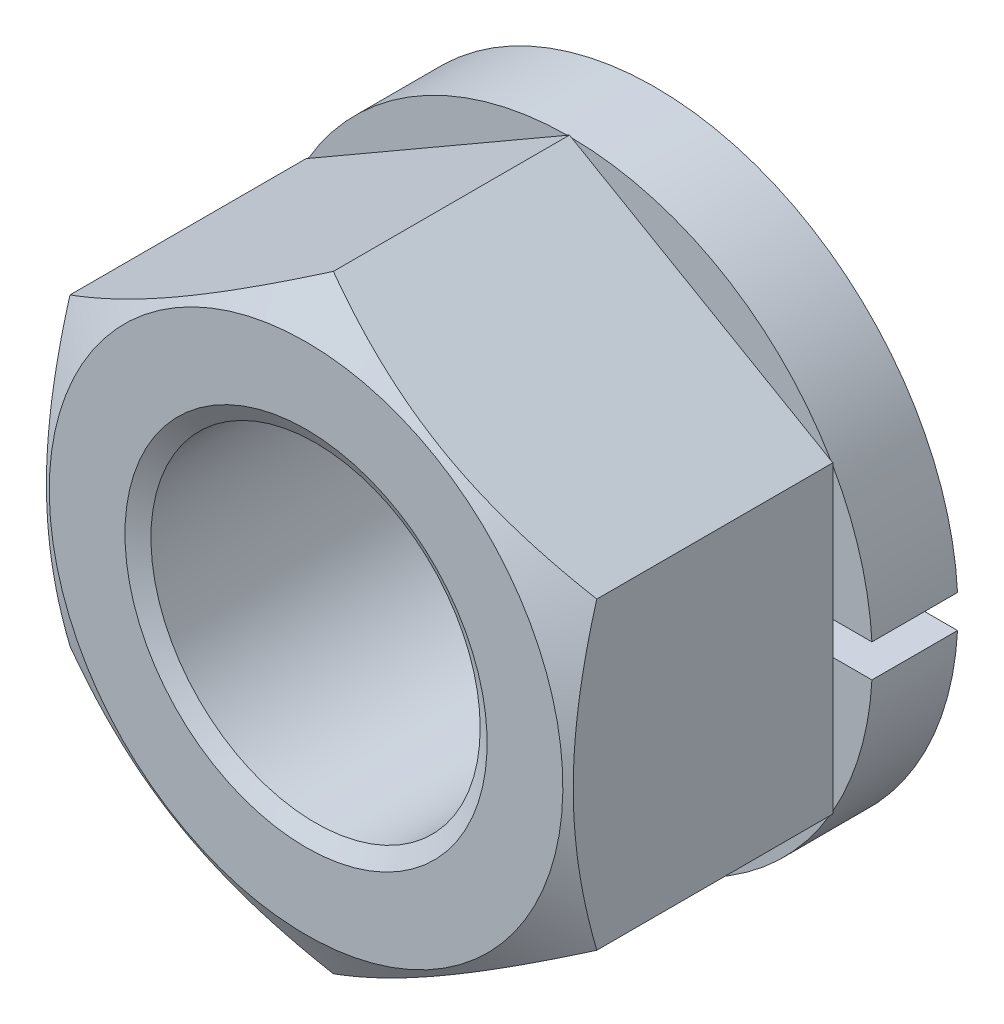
ISO-10303-21;
HEADER;
FILE_DESCRIPTION(('STEP AP214'),'2;1');
FILE_NAME('part.step','',(''),(''),'','','');
FILE_SCHEMA(('AUTOMOTIVE_DESIGN { 1 0 10303 214 1 1 1 1 }'));
ENDSEC;
DATA;
#1=APPLICATION_CONTEXT('core data for automotive mechanical design processes');
#2=APPLICATION_PROTOCOL_DEFINITION('international standard','automotive_design',2000,#1);
#3=PRODUCT_CONTEXT('',#1,'mechanical');
#4=PRODUCT('Part','Part','',(#3));
#5=PRODUCT_RELATED_PRODUCT_CATEGORY('part','',(#4));
#6=PRODUCT_DEFINITION_FORMATION('','',#4);
#7=PRODUCT_DEFINITION_CONTEXT('part definition',#1,'design');
#8=PRODUCT_DEFINITION('design','',#6,#7);
#9=PRODUCT_DEFINITION_SHAPE('','',#8);
#10=(LENGTH_UNIT() NAMED_UNIT(*) SI_UNIT(.MILLI.,.METRE.));
#11=(NAMED_UNIT(*) PLANE_ANGLE_UNIT() SI_UNIT($,.RADIAN.));
#12=(NAMED_UNIT(*) SI_UNIT($,.STERADIAN.) SOLID_ANGLE_UNIT());
#13=UNCERTAINTY_MEASURE_WITH_UNIT(LENGTH_MEASURE(1.E-05),#10,'distance_accuracy_value','');
#14=(GEOMETRIC_REPRESENTATION_CONTEXT(3) GLOBAL_UNCERTAINTY_ASSIGNED_CONTEXT((#13)) GLOBAL_UNIT_ASSIGNED_CONTEXT((#10,
#11,#12)) REPRESENTATION_CONTEXT('',''));
#15=CARTESIAN_POINT('',(0.,0.,0.));
#16=DIRECTION('',(0.,0.,1.));
#17=DIRECTION('',(1.,0.,0.));
#18=AXIS2_PLACEMENT_3D('',#15,#16,#17);
#19=CARTESIAN_POINT('',(4.,-6.92820323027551,1.3));
#20=DIRECTION('',(0.,0.,1.));
#21=DIRECTION('',(0.,1.,0.));
#22=AXIS2_PLACEMENT_3D('',#19,#20,#21);
#23=PLANE('',#22);
#24=CARTESIAN_POINT('',(0.,0.,1.3));
#25=DIRECTION('',(0.,0.,-1.));
#26=DIRECTION('',(0.,1.,0.));
#27=AXIS2_PLACEMENT_3D('',#24,#25,#26);
#28=CIRCLE('',#27,4.6);
#29=CARTESIAN_POINT('',(4.,-2.27156333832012,1.3));
#30=VERTEX_POINT('',#29);
#31=CARTESIAN_POINT('',(3.9672315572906,-2.3283199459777,1.3));
#32=VERTEX_POINT('',#31);
#33=EDGE_CURVE('E9',#30,#32,#28,.T.);
#34=ORIENTED_EDGE('',*,*,#33,.F.);
#35=DIRECTION('',(0.,1.,0.));
#36=VECTOR('',#35,1.);
#37=CARTESIAN_POINT('',(4.,-2.30940107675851,1.3));
#38=LINE('',#37,#36);
#39=CARTESIAN_POINT('',(4.,-2.30940107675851,1.3));
#40=VERTEX_POINT('',#39);
#41=EDGE_CURVE('E189',#40,#30,#38,.T.);
#42=ORIENTED_EDGE('',*,*,#41,.F.);
#43=DIRECTION('',(0.866025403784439,0.5,0.));
#44=VECTOR('',#43,1.);
#45=CARTESIAN_POINT('',(0.,-4.61880215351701,1.3));
#46=LINE('',#45,#44);
#47=EDGE_CURVE('E191',#32,#40,#46,.T.);
#48=ORIENTED_EDGE('',*,*,#47,.F.);
#49=EDGE_LOOP('',(#34,#42,#48));
#50=FACE_BOUND('',#49,.T.);
#51=ADVANCED_FACE('F14',(#50),#23,.F.);
#52=CARTESIAN_POINT('',(0.0327684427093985,-4.59988328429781,1.3));
#53=VERTEX_POINT('',#52);
#54=CARTESIAN_POINT('',(-0.0327684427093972,-4.59988328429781,1.3));
#55=VERTEX_POINT('',#54);
#56=EDGE_CURVE('E24',#53,#55,#28,.T.);
#57=ORIENTED_EDGE('',*,*,#56,.F.);
#58=CARTESIAN_POINT('',(0.,-4.61880215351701,1.3));
#59=VERTEX_POINT('',#58);
#60=EDGE_CURVE('E188',#59,#53,#46,.T.);
#61=ORIENTED_EDGE('',*,*,#60,.F.);
#62=DIRECTION('',(0.866025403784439,-0.5,0.));
#63=VECTOR('',#62,1.);
#64=CARTESIAN_POINT('',(-4.,-2.30940107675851,1.3));
#65=LINE('',#64,#63);
#66=EDGE_CURVE('E289',#55,#59,#65,.T.);
#67=ORIENTED_EDGE('',*,*,#66,.F.);
#68=EDGE_LOOP('',(#57,#61,#67));
#69=FACE_BOUND('',#68,.T.);
#70=ADVANCED_FACE('F387',(#69),#23,.F.);
#71=CARTESIAN_POINT('',(-3.9672315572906,-2.3283199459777,1.3));
#72=VERTEX_POINT('',#71);
#73=CARTESIAN_POINT('',(-4.,-2.27156333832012,1.3));
#74=VERTEX_POINT('',#73);
#75=EDGE_CURVE('E608',#72,#74,#28,.T.);
#76=ORIENTED_EDGE('',*,*,#75,.F.);
#77=CARTESIAN_POINT('',(-4.,-2.30940107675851,1.3));
#78=VERTEX_POINT('',#77);
#79=EDGE_CURVE('E285',#78,#72,#65,.T.);
#80=ORIENTED_EDGE('',*,*,#79,.F.);
#81=DIRECTION('',(0.,-1.,0.));
#82=VECTOR('',#81,1.);
#83=CARTESIAN_POINT('',(-4.,2.30940107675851,1.3));
#84=LINE('',#83,#82);
#85=EDGE_CURVE('E248',#74,#78,#84,.T.);
#86=ORIENTED_EDGE('',*,*,#85,.F.);
#87=EDGE_LOOP('',(#76,#80,#86));
#88=FACE_BOUND('',#87,.T.);
#89=ADVANCED_FACE('F623',(#88),#23,.F.);
#90=CARTESIAN_POINT('',(-4.,2.27156333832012,1.3));
#91=VERTEX_POINT('',#90);
#92=CARTESIAN_POINT('',(-3.9672315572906,2.3283199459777,1.3));
#93=VERTEX_POINT('',#92);
#94=EDGE_CURVE('E266',#91,#93,#28,.T.);
#95=ORIENTED_EDGE('',*,*,#94,.F.);
#96=CARTESIAN_POINT('',(-4.,2.30940107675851,1.3));
#97=VERTEX_POINT('',#96);
#98=EDGE_CURVE('E244',#97,#91,#84,.T.);
#99=ORIENTED_EDGE('',*,*,#98,.F.);
#100=DIRECTION('',(-0.866025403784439,-0.5,0.));
#101=VECTOR('',#100,1.);
#102=CARTESIAN_POINT('',(0.,4.61880215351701,1.3));
#103=LINE('',#102,#101);
#104=EDGE_CURVE('E252',#93,#97,#103,.T.);
#105=ORIENTED_EDGE('',*,*,#104,.F.);
#106=EDGE_LOOP('',(#95,#99,#105));
#107=FACE_BOUND('',#106,.T.);
#108=ADVANCED_FACE('F612',(#107),#23,.F.);
#109=CARTESIAN_POINT('',(-0.0327684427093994,4.59988328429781,1.3));
#110=VERTEX_POINT('',#109);
#111=CARTESIAN_POINT('',(0.0327684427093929,4.59988328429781,1.3));
#112=VERTEX_POINT('',#111);
#113=EDGE_CURVE('E179',#110,#112,#28,.T.);
#114=ORIENTED_EDGE('',*,*,#113,.F.);
#115=CARTESIAN_POINT('',(0.,4.61880215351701,1.3));
#116=VERTEX_POINT('',#115);
#117=EDGE_CURVE('E249',#116,#110,#103,.T.);
#118=ORIENTED_EDGE('',*,*,#117,.F.);
#119=DIRECTION('',(-0.866025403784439,0.5,0.));
#120=VECTOR('',#119,1.);
#121=CARTESIAN_POINT('',(4.,2.3094010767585,1.3));
#122=LINE('',#121,#120);
#123=EDGE_CURVE('E194',#112,#116,#122,.T.);
#124=ORIENTED_EDGE('',*,*,#123,.F.);
#125=EDGE_LOOP('',(#114,#118,#124));
#126=FACE_BOUND('',#125,.T.);
#127=ADVANCED_FACE('F268',(#126),#23,.F.);
#128=CARTESIAN_POINT('',(3.96723155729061,2.32831994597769,1.3));
#129=VERTEX_POINT('',#128);
#130=CARTESIAN_POINT('',(4.,2.27156333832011,1.3));
#131=VERTEX_POINT('',#130);
#132=EDGE_CURVE('E168',#129,#131,#28,.T.);
#133=ORIENTED_EDGE('',*,*,#132,.F.);
#134=CARTESIAN_POINT('',(4.,2.3094010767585,1.3));
#135=VERTEX_POINT('',#134);
#136=EDGE_CURVE('E187',#135,#129,#122,.T.);
#137=ORIENTED_EDGE('',*,*,#136,.F.);
#138=EDGE_CURVE('E156',#131,#135,#38,.T.);
#139=ORIENTED_EDGE('',*,*,#138,.F.);
#140=EDGE_LOOP('',(#133,#137,#139));
#141=FACE_BOUND('',#140,.T.);
#142=ADVANCED_FACE('F186',(#141),#23,.F.);
#143=DIRECTION('',(1.,0.,0.));
#144=VECTOR('',#143,1.);
#145=CARTESIAN_POINT('',(2.53771550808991,-0.25,1.3));
#146=LINE('',#145,#144);
#147=CARTESIAN_POINT('',(2.73861278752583,-0.25,1.3));
#148=VERTEX_POINT('',#147);
#149=CARTESIAN_POINT('',(4.,-0.25,1.3));
#150=VERTEX_POINT('',#149);
#151=EDGE_CURVE('E180',#148,#150,#146,.T.);
#152=ORIENTED_EDGE('',*,*,#151,.F.);
#153=CARTESIAN_POINT('',(0.,0.,1.3));
#154=DIRECTION('',(0.,0.,1.));
#155=DIRECTION('',(0.,1.,0.));
#156=AXIS2_PLACEMENT_3D('',#153,#154,#155);
#157=CIRCLE('',#156,2.75);
#158=CARTESIAN_POINT('',(2.73861278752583,0.25,1.3));
#159=VERTEX_POINT('',#158);
#160=EDGE_CURVE('E217',#148,#159,#157,.T.);
#161=ORIENTED_EDGE('',*,*,#160,.T.);
#162=DIRECTION('',(-1.,0.,0.));
#163=VECTOR('',#162,1.);
#164=CARTESIAN_POINT('',(2.53771550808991,0.25,1.3));
#165=LINE('',#164,#163);
#166=CARTESIAN_POINT('',(4.,0.25,1.3));
#167=VERTEX_POINT('',#166);
#168=EDGE_CURVE('E215',#167,#159,#165,.T.);
#169=ORIENTED_EDGE('',*,*,#168,.F.);
#170=EDGE_CURVE('E160',#150,#167,#38,.T.);
#171=ORIENTED_EDGE('',*,*,#170,.F.);
#172=EDGE_LOOP('',(#152,#161,#169,#171));
#173=FACE_BOUND('',#172,.T.);
#174=ADVANCED_FACE('F211',(#173),#23,.F.);
#175=CARTESIAN_POINT('',(-4.,-2.30940107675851,5.3));
#176=DIRECTION('',(0.5,0.866025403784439,0.));
#177=DIRECTION('',(-0.866025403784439,0.5,0.));
#178=AXIS2_PLACEMENT_3D('',#175,#176,#177);
#179=PLANE('',#178);
#180=CARTESIAN_POINT('',(-4.0002,-2.30928560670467,4.88493271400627));
#181=CARTESIAN_POINT('',(-3.82442084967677,-2.41077174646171,4.94354709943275));
#182=CARTESIAN_POINT('',(-3.64712438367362,-2.513133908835,4.99685465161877));
#183=CARTESIAN_POINT('',(-3.28946140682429,-2.71963072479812,5.08990330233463));
#184=CARTESIAN_POINT('',(-3.10908854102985,-2.82376904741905,5.12961148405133));
#185=CARTESIAN_POINT('',(-2.75057818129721,-3.03075510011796,5.19142275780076));
#186=CARTESIAN_POINT('',(-2.57249584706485,-3.13357098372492,5.21393724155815));
#187=CARTESIAN_POINT('',(-2.21549328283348,-3.33968651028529,5.24081434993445));
#188=CARTESIAN_POINT('',(-2.03657435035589,-3.44298540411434,5.24519923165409));
#189=CARTESIAN_POINT('',(-1.70225715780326,-3.63600352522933,5.23607490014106));
#190=CARTESIAN_POINT('',(-1.54680884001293,-3.72575165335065,5.22480601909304));
#191=CARTESIAN_POINT('',(-1.23692494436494,-3.90466320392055,5.18909098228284));
#192=CARTESIAN_POINT('',(-1.08249043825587,-3.99382600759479,5.1646326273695));
#193=CARTESIAN_POINT('',(-0.77196767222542,-4.17310641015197,5.10348890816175));
#194=CARTESIAN_POINT('',(-0.615918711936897,-4.26320131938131,5.06654436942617));
#195=CARTESIAN_POINT('',(-0.306148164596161,-4.4420474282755,4.98269490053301));
#196=CARTESIAN_POINT('',(-0.152422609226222,-4.53080091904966,4.9358096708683));
#197=CARTESIAN_POINT('',(0.000199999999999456,-4.61891762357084,4.88493271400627));
#198=B_SPLINE_CURVE_WITH_KNOTS('',3,(#180,#181,#182,#183,#184,#185,#186,#187,#188,#189,#190,
#191,#192,#193,#194,#195,#196,#197),.UNSPECIFIED.,.F.,.F.,(4,2,2,2,2,2,2,2,4),(0.,
0.634047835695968,1.26961969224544,1.88946157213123,2.50854226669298,3.04757825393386,
3.58711366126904,4.13861653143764,4.68903648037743),.UNSPECIFIED.);
#199=CARTESIAN_POINT('',(-4.,-2.30940107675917,4.88499938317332));
#200=VERTEX_POINT('',#199);
#201=CARTESIAN_POINT('',(0.,-4.61880215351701,4.88499938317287));
#202=VERTEX_POINT('',#201);
#203=EDGE_CURVE('E296',#200,#202,#198,.T.);
#204=ORIENTED_EDGE('',*,*,#203,.F.);
#205=DIRECTION('',(0.,0.,-1.));
#206=VECTOR('',#205,1.);
#207=CARTESIAN_POINT('',(-4.,-2.30940107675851,5.3));
#208=LINE('',#207,#206);
#209=EDGE_CURVE('E241',#200,#78,#208,.T.);
#210=ORIENTED_EDGE('',*,*,#209,.T.);
#211=ORIENTED_EDGE('',*,*,#79,.T.);
#212=EDGE_CURVE('E287',#72,#55,#65,.T.);
#213=ORIENTED_EDGE('',*,*,#212,.T.);
#214=ORIENTED_EDGE('',*,*,#66,.T.);
#215=DIRECTION('',(0.,0.,-1.));
#216=VECTOR('',#215,1.);
#217=CARTESIAN_POINT('',(0.,-4.61880215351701,5.3));
#218=LINE('',#217,#216);
#219=EDGE_CURVE('E220',#202,#59,#218,.T.);
#220=ORIENTED_EDGE('',*,*,#219,.F.);
#221=EDGE_LOOP('',(#204,#210,#211,#213,#214,#220));
#222=FACE_BOUND('',#221,.T.);
#223=ADVANCED_FACE('F309',(#222),#179,.F.);
#224=CARTESIAN_POINT('',(0.,-4.61880215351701,5.3));
#225=DIRECTION('',(-0.5,0.866025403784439,0.));
#226=DIRECTION('',(-0.866025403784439,-0.5,0.));
#227=AXIS2_PLACEMENT_3D('',#224,#225,#226);
#228=PLANE('',#227);
#229=CARTESIAN_POINT('',(-0.000200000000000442,-4.61891762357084,4.88493271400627));
#230=CARTESIAN_POINT('',(0.17557915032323,-4.5174314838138,4.94354709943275));
#231=CARTESIAN_POINT('',(0.352875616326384,-4.41506932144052,4.99685465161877));
#232=CARTESIAN_POINT('',(0.71053859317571,-4.2085725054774,5.08990330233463));
#233=CARTESIAN_POINT('',(0.890911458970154,-4.10443418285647,5.12961148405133));
#234=CARTESIAN_POINT('',(1.24942181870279,-3.89744813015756,5.19142275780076));
#235=CARTESIAN_POINT('',(1.42750415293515,-3.7946322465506,5.21393724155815));
#236=CARTESIAN_POINT('',(1.78450671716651,-3.58851671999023,5.24081434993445));
#237=CARTESIAN_POINT('',(1.9634256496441,-3.48521782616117,5.24519923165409));
#238=CARTESIAN_POINT('',(2.29774284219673,-3.29219970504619,5.23607490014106));
#239=CARTESIAN_POINT('',(2.45319115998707,-3.20245157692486,5.22480601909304));
#240=CARTESIAN_POINT('',(2.76307505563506,-3.02354002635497,5.18909098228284));
#241=CARTESIAN_POINT('',(2.91750956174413,-2.93437722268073,5.1646326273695));
#242=CARTESIAN_POINT('',(3.22803232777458,-2.75509682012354,5.10348890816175));
#243=CARTESIAN_POINT('',(3.3840812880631,-2.6650019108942,5.06654436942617));
#244=CARTESIAN_POINT('',(3.69385183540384,-2.48615580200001,4.98269490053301));
#245=CARTESIAN_POINT('',(3.84757739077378,-2.39740231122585,4.9358096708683));
#246=CARTESIAN_POINT('',(4.0002,-2.30928560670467,4.88493271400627));
#247=B_SPLINE_CURVE_WITH_KNOTS('',3,(#229,#230,#231,#232,#233,#234,#235,#236,#237,#238,#239,
#240,#241,#242,#243,#244,#245,#246),.UNSPECIFIED.,.F.,.F.,(4,2,2,2,2,2,2,2,4),(0.,
0.634047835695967,1.26961969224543,1.88946157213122,2.50854226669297,3.04757825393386,
3.58711366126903,4.13861653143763,4.68903648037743),.UNSPECIFIED.);
#248=CARTESIAN_POINT('',(4.,-2.30940107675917,4.88499938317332));
#249=VERTEX_POINT('',#248);
#250=EDGE_CURVE('E278',#202,#249,#247,.T.);
#251=ORIENTED_EDGE('',*,*,#250,.F.);
#252=ORIENTED_EDGE('',*,*,#219,.T.);
#253=ORIENTED_EDGE('',*,*,#60,.T.);
#254=EDGE_CURVE('E34',#53,#32,#46,.T.);
#255=ORIENTED_EDGE('',*,*,#254,.T.);
#256=ORIENTED_EDGE('',*,*,#47,.T.);
#257=DIRECTION('',(0.,0.,-1.));
#258=VECTOR('',#257,1.);
#259=CARTESIAN_POINT('',(4.,-2.30940107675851,5.3));
#260=LINE('',#259,#258);
#261=EDGE_CURVE('E224',#249,#40,#260,.T.);
#262=ORIENTED_EDGE('',*,*,#261,.F.);
#263=EDGE_LOOP('',(#251,#252,#253,#255,#256,#262));
#264=FACE_BOUND('',#263,.T.);
#265=ADVANCED_FACE('F281',(#264),#228,.F.);
#266=CARTESIAN_POINT('',(4.,-2.30940107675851,5.3));
#267=DIRECTION('',(-1.,0.,0.));
#268=DIRECTION('',(0.,-1.,0.));
#269=AXIS2_PLACEMENT_3D('',#266,#267,#268);
#270=PLANE('',#269);
#271=CARTESIAN_POINT('',(4.,-6.19830752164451,3.29259666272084));
#272=CARTESIAN_POINT('',(4.,-6.02358741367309,3.37733132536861));
#273=CARTESIAN_POINT('',(4.,-5.84846556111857,3.46125183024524));
#274=CARTESIAN_POINT('',(4.,-5.497204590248,3.62700632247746));
#275=CARTESIAN_POINT('',(4.,-5.3210653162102,3.7088399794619));
#276=CARTESIAN_POINT('',(4.,-4.96664644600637,3.87037504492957));
#277=CARTESIAN_POINT('',(4.,-4.7883604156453,3.95006238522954));
#278=CARTESIAN_POINT('',(4.,-4.43036789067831,4.10616743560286));
#279=CARTESIAN_POINT('',(4.,-4.25066146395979,4.1825853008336));
#280=CARTESIAN_POINT('',(4.,-3.883877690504,4.33362019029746));
#281=CARTESIAN_POINT('',(4.,-3.69674587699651,4.40810566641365));
#282=CARTESIAN_POINT('',(4.,-3.32029141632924,4.55142705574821));
#283=CARTESIAN_POINT('',(4.,-3.13096852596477,4.62026233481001));
#284=CARTESIAN_POINT('',(4.,-2.75018617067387,4.75047348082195));
#285=CARTESIAN_POINT('',(4.,-2.55873192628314,4.81186446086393));
#286=CARTESIAN_POINT('',(4.,-2.17307788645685,4.92521431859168));
#287=CARTESIAN_POINT('',(4.,-1.97887897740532,4.97717616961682));
#288=CARTESIAN_POINT('',(4.,-1.58864256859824,5.06891001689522));
#289=CARTESIAN_POINT('',(4.,-1.3926199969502,5.10874434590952));
#290=CARTESIAN_POINT('',(4.,-0.998143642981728,5.17394634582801));
#291=CARTESIAN_POINT('',(4.,-0.799690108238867,5.19931547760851));
#292=CARTESIAN_POINT('',(4.,-0.403932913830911,5.23323151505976));
#293=CARTESIAN_POINT('',(4.,-0.206648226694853,5.24199435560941));
#294=CARTESIAN_POINT('',(4.,0.187963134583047,5.24252299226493));
#295=CARTESIAN_POINT('',(4.,0.385289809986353,5.23428817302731));
#296=CARTESIAN_POINT('',(4.,0.720346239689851,5.206455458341));
#297=CARTESIAN_POINT('',(4.,0.858435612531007,5.19094029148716));
#298=CARTESIAN_POINT('',(4.,1.13359497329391,5.15255337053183));
#299=CARTESIAN_POINT('',(4.,1.27066482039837,5.12968061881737));
#300=CARTESIAN_POINT('',(4.,1.68015906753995,5.05122936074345));
#301=CARTESIAN_POINT('',(4.,1.95072275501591,4.98583152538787));
#302=CARTESIAN_POINT('',(4.,2.35547112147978,4.87249475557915));
#303=CARTESIAN_POINT('',(4.,2.4917524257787,4.83161840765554));
#304=CARTESIAN_POINT('',(4.,2.76298992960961,4.74564464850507));
#305=CARTESIAN_POINT('',(4.,2.89794611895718,4.7005472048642));
#306=CARTESIAN_POINT('',(4.,3.16657958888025,4.60685321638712));
#307=CARTESIAN_POINT('',(4.,3.30025725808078,4.55825777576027));
#308=CARTESIAN_POINT('',(4.,3.56650379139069,4.45813729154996));
#309=CARTESIAN_POINT('',(4.,3.6990726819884,4.40661231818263));
#310=CARTESIAN_POINT('',(4.,4.06393124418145,4.26091200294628));
#311=CARTESIAN_POINT('',(4.,4.2951943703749,4.16416822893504));
#312=CARTESIAN_POINT('',(4.,4.75532375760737,3.9651196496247));
#313=CARTESIAN_POINT('',(4.,4.98418974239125,3.86281421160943));
#314=CARTESIAN_POINT('',(4.,5.44008918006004,3.65400373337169));
#315=CARTESIAN_POINT('',(4.,5.66712195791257,3.54749722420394));
#316=CARTESIAN_POINT('',(4.,6.11967322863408,3.33130772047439));
#317=CARTESIAN_POINT('',(4.,6.3451916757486,3.22162463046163));
#318=CARTESIAN_POINT('',(4.,6.79536429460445,2.9996241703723));
#319=CARTESIAN_POINT('',(4.,7.02001656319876,2.88730294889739));
#320=CARTESIAN_POINT('',(4.,7.46833630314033,2.66071005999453));
#321=CARTESIAN_POINT('',(4.,7.69200376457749,2.54643837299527));
#322=CARTESIAN_POINT('',(4.,8.36171005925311,2.20135857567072));
#323=CARTESIAN_POINT('',(4.,8.80655510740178,1.96823479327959));
#324=CARTESIAN_POINT('',(4.,9.64574719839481,1.52350784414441));
#325=CARTESIAN_POINT('',(4.,10.0403183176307,1.31232552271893));
#326=CARTESIAN_POINT('',(4.,10.8282076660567,0.887578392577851));
#327=CARTESIAN_POINT('',(4.,11.2215258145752,0.674013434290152));
#328=CARTESIAN_POINT('',(4.,12.005915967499,0.245830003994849));
#329=CARTESIAN_POINT('',(4.,12.3969911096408,0.0312172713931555));
#330=CARTESIAN_POINT('',(4.,13.1783621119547,-0.399350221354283));
#331=CARTESIAN_POINT('',(4.,13.5686580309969,-0.615304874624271));
#332=CARTESIAN_POINT('',(4.,13.9586822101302,-0.831746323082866));
#333=B_SPLINE_CURVE_WITH_KNOTS('',3,(#271,#272,#273,#274,#275,#276,#277,#278,#279,#280,#281,
#282,#283,#284,#285,#286,#287,#288,#289,#290,#291,#292,#293,#294,#295,#296,#297,#298,#299,#300,
#301,#302,#303,#304,#305,#306,#307,#308,#309,#310,#311,#312,#313,#314,#315,#316,#317,#318,#319,
#320,#321,#322,#323,#324,#325,#326,#327,#328,#329,#330,#331,#332),.UNSPECIFIED.,.F.,.F.,(4,2,2,
2,2,2,2,2,2,2,2,2,2,2,2,2,2,2,2,2,2,2,2,2,2,2,2,2,2,2,4),(0.,0.582556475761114,1.16520461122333,
1.75103140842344,2.33683037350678,2.94099294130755,3.54522322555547,4.14820552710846,
4.75099735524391,5.35063652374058,5.95021512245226,6.54194230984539,7.13369091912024,
7.55036371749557,7.9670930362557,8.80098786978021,9.22779049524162,9.65459639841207,
10.081268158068,10.5079296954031,11.259867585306,12.0118911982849,12.7641801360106,
13.5164917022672,14.2699797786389,15.0234754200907,16.5301238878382,17.8727098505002,
19.2153805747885,20.553654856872,21.891823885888),.UNSPECIFIED.);
#334=CARTESIAN_POINT('',(4.,2.3094010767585,4.88499938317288));
#335=VERTEX_POINT('',#334);
#336=EDGE_CURVE('E275',#249,#335,#333,.T.);
#337=ORIENTED_EDGE('',*,*,#336,.F.);
#338=ORIENTED_EDGE('',*,*,#261,.T.);
#339=ORIENTED_EDGE('',*,*,#41,.T.);
#340=EDGE_CURVE('E195',#30,#150,#38,.T.);
#341=ORIENTED_EDGE('',*,*,#340,.T.);
#342=ORIENTED_EDGE('',*,*,#170,.T.);
#343=EDGE_CURVE('E150',#167,#131,#38,.T.);
#344=ORIENTED_EDGE('',*,*,#343,.T.);
#345=ORIENTED_EDGE('',*,*,#138,.T.);
#346=DIRECTION('',(0.,0.,-1.));
#347=VECTOR('',#346,1.);
#348=CARTESIAN_POINT('',(4.,2.3094010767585,5.3));
#349=LINE('',#348,#347);
#350=EDGE_CURVE('E233',#335,#135,#349,.T.);
#351=ORIENTED_EDGE('',*,*,#350,.F.);
#352=EDGE_LOOP('',(#337,#338,#339,#341,#342,#344,#345,#351));
#353=FACE_BOUND('',#352,.T.);
#354=ADVANCED_FACE('F153',(#353),#270,.F.);
#355=CARTESIAN_POINT('',(4.,2.3094010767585,5.3));
#356=DIRECTION('',(-0.5,-0.866025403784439,0.));
#357=DIRECTION('',(0.866025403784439,-0.5,0.));
#358=AXIS2_PLACEMENT_3D('',#355,#356,#357);
#359=PLANE('',#358);
#360=CARTESIAN_POINT('',(4.0002,2.30928560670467,4.88493271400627));
#361=CARTESIAN_POINT('',(3.82442084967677,2.4107717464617,4.94354709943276));
#362=CARTESIAN_POINT('',(3.64712438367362,2.51313390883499,4.99685465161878));
#363=CARTESIAN_POINT('',(3.28946140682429,2.71963072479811,5.08990330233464));
#364=CARTESIAN_POINT('',(3.10908854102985,2.82376904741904,5.12961148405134));
#365=CARTESIAN_POINT('',(2.75057818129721,3.03075510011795,5.19142275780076));
#366=CARTESIAN_POINT('',(2.57249584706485,3.13357098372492,5.21393724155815));
#367=CARTESIAN_POINT('',(2.21549328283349,3.33968651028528,5.24081434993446));
#368=CARTESIAN_POINT('',(2.03657435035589,3.44298540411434,5.2451992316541));
#369=CARTESIAN_POINT('',(1.70225715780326,3.63600352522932,5.23607490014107));
#370=CARTESIAN_POINT('',(1.54680884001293,3.72575165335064,5.22480601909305));
#371=CARTESIAN_POINT('',(1.23692494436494,3.90466320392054,5.18909098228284));
#372=CARTESIAN_POINT('',(1.08249043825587,3.99382600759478,5.16463262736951));
#373=CARTESIAN_POINT('',(0.771967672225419,4.17310641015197,5.10348890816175));
#374=CARTESIAN_POINT('',(0.615918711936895,4.26320131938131,5.06654436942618));
#375=CARTESIAN_POINT('',(0.306148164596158,4.4420474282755,4.98269490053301));
#376=CARTESIAN_POINT('',(0.152422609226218,4.53080091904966,4.9358096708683));
#377=CARTESIAN_POINT('',(-0.000200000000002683,4.61891762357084,4.88493271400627));
#378=B_SPLINE_CURVE_WITH_KNOTS('',3,(#360,#361,#362,#363,#364,#365,#366,#367,#368,#369,#370,
#371,#372,#373,#374,#375,#376,#377),.UNSPECIFIED.,.F.,.F.,(4,2,2,2,2,2,2,2,4),(0.,
0.634047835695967,1.26961969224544,1.88946157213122,2.50854226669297,3.04757825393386,
3.58711366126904,4.13861653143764,4.68903648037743),.UNSPECIFIED.);
#379=CARTESIAN_POINT('',(0.,4.61880215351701,4.88499938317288));
#380=VERTEX_POINT('',#379);
#381=EDGE_CURVE('E274',#335,#380,#378,.T.);
#382=ORIENTED_EDGE('',*,*,#381,.F.);
#383=ORIENTED_EDGE('',*,*,#350,.T.);
#384=ORIENTED_EDGE('',*,*,#136,.T.);
#385=EDGE_CURVE('E198',#129,#112,#122,.T.);
#386=ORIENTED_EDGE('',*,*,#385,.T.);
#387=ORIENTED_EDGE('',*,*,#123,.T.);
#388=DIRECTION('',(0.,0.,-1.));
#389=VECTOR('',#388,1.);
#390=CARTESIAN_POINT('',(0.,4.61880215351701,5.3));
#391=LINE('',#390,#389);
#392=EDGE_CURVE('E235',#380,#116,#391,.T.);
#393=ORIENTED_EDGE('',*,*,#392,.F.);
#394=EDGE_LOOP('',(#382,#383,#384,#386,#387,#393));
#395=FACE_BOUND('',#394,.T.);
#396=ADVANCED_FACE('F255',(#395),#359,.F.);
#397=CARTESIAN_POINT('',(0.,4.61880215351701,5.3));
#398=DIRECTION('',(0.5,-0.866025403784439,0.));
#399=DIRECTION('',(0.866025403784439,0.5,0.));
#400=AXIS2_PLACEMENT_3D('',#397,#398,#399);
#401=PLANE('',#400);
#402=CARTESIAN_POINT('',(0.000199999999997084,4.61891762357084,4.88493271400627));
#403=CARTESIAN_POINT('',(-0.175579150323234,4.5174314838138,4.94354709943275));
#404=CARTESIAN_POINT('',(-0.352875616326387,4.41506932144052,4.99685465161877));
#405=CARTESIAN_POINT('',(-0.710538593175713,4.2085725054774,5.08990330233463));
#406=CARTESIAN_POINT('',(-0.890911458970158,4.10443418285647,5.12961148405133));
#407=CARTESIAN_POINT('',(-1.2494218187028,3.89744813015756,5.19142275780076));
#408=CARTESIAN_POINT('',(-1.42750415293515,3.7946322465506,5.21393724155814));
#409=CARTESIAN_POINT('',(-1.78450671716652,3.58851671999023,5.24081434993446));
#410=CARTESIAN_POINT('',(-1.9634256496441,3.48521782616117,5.2451992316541));
#411=CARTESIAN_POINT('',(-2.29774284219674,3.29219970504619,5.23607490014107));
#412=CARTESIAN_POINT('',(-2.45319115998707,3.20245157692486,5.22480601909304));
#413=CARTESIAN_POINT('',(-2.76307505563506,3.02354002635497,5.18909098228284));
#414=CARTESIAN_POINT('',(-2.91750956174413,2.93437722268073,5.1646326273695));
#415=CARTESIAN_POINT('',(-3.22803232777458,2.75509682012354,5.10348890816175));
#416=CARTESIAN_POINT('',(-3.38408128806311,2.6650019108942,5.06654436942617));
#417=CARTESIAN_POINT('',(-3.69385183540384,2.48615580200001,4.98269490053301));
#418=CARTESIAN_POINT('',(-3.84757739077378,2.39740231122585,4.93580967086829));
#419=CARTESIAN_POINT('',(-4.0002,2.30928560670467,4.88493271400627));
#420=B_SPLINE_CURVE_WITH_KNOTS('',3,(#402,#403,#404,#405,#406,#407,#408,#409,#410,#411,#412,
#413,#414,#415,#416,#417,#418,#419),.UNSPECIFIED.,.F.,.F.,(4,2,2,2,2,2,2,2,4),(0.,
0.634047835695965,1.26961969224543,1.88946157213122,2.50854226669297,3.04757825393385,
3.58711366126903,4.13861653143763,4.68903648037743),.UNSPECIFIED.);
#421=CARTESIAN_POINT('',(-4.,2.30940107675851,4.88499938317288));
#422=VERTEX_POINT('',#421);
#423=EDGE_CURVE('E273',#380,#422,#420,.T.);
#424=ORIENTED_EDGE('',*,*,#423,.F.);
#425=ORIENTED_EDGE('',*,*,#392,.T.);
#426=ORIENTED_EDGE('',*,*,#117,.T.);
#427=EDGE_CURVE('E251',#110,#93,#103,.T.);
#428=ORIENTED_EDGE('',*,*,#427,.T.);
#429=ORIENTED_EDGE('',*,*,#104,.T.);
#430=DIRECTION('',(0.,0.,-1.));
#431=VECTOR('',#430,1.);
#432=CARTESIAN_POINT('',(-4.,2.30940107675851,5.3));
#433=LINE('',#432,#431);
#434=EDGE_CURVE('E238',#422,#97,#433,.T.);
#435=ORIENTED_EDGE('',*,*,#434,.F.);
#436=EDGE_LOOP('',(#424,#425,#426,#428,#429,#435));
#437=FACE_BOUND('',#436,.T.);
#438=ADVANCED_FACE('F271',(#437),#401,.F.);
#439=CARTESIAN_POINT('',(-4.,2.30940107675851,5.3));
#440=DIRECTION('',(1.,0.,0.));
#441=DIRECTION('',(0.,1.,0.));
#442=AXIS2_PLACEMENT_3D('',#439,#440,#441);
#443=PLANE('',#442);
#444=CARTESIAN_POINT('',(-4.,-6.19830752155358,3.29259666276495));
#445=CARTESIAN_POINT('',(-4.,-6.02358741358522,3.37733132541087));
#446=CARTESIAN_POINT('',(-4.,-5.84846556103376,3.46125183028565));
#447=CARTESIAN_POINT('',(-4.,-5.49720459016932,3.62700632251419));
#448=CARTESIAN_POINT('',(-4.,-5.32106531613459,3.70883997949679));
#449=CARTESIAN_POINT('',(-4.,-4.96664644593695,3.87037504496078));
#450=CARTESIAN_POINT('',(-4.,-4.78836041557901,3.95006238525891));
#451=CARTESIAN_POINT('',(-4.,-4.43036789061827,4.10616743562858));
#452=CARTESIAN_POINT('',(-4.,-4.2506614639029,4.18258530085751));
#453=CARTESIAN_POINT('',(-4.,-3.88387769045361,4.33362019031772));
#454=CARTESIAN_POINT('',(-4.,-3.69674587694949,4.40810566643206));
#455=CARTESIAN_POINT('',(-4.,-3.320291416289,4.55142705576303));
#456=CARTESIAN_POINT('',(-4.,-3.13096852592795,4.62026233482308));
#457=CARTESIAN_POINT('',(-4.,-2.75018617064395,4.7504734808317));
#458=CARTESIAN_POINT('',(-4.,-2.5587319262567,4.8118644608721));
#459=CARTESIAN_POINT('',(-4.,-2.17307788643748,4.92521431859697));
#460=CARTESIAN_POINT('',(-4.,-1.97887897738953,4.97717616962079));
#461=CARTESIAN_POINT('',(-4.,-1.58864256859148,5.06891001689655));
#462=CARTESIAN_POINT('',(-4.,-1.39261999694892,5.10874434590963));
#463=CARTESIAN_POINT('',(-4.,-0.998143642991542,5.1739463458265));
#464=CARTESIAN_POINT('',(-4.,-0.799690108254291,5.1993154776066));
#465=CARTESIAN_POINT('',(-4.,-0.40393291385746,5.23323151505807));
#466=CARTESIAN_POINT('',(-4.,-0.206648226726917,5.2419943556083));
#467=CARTESIAN_POINT('',(-4.,0.187963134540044,5.24252299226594));
#468=CARTESIAN_POINT('',(-4.,0.385289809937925,5.23428817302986));
#469=CARTESIAN_POINT('',(-4.,0.72034623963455,5.20645545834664));
#470=CARTESIAN_POINT('',(-4.,0.858435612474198,5.19094029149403));
#471=CARTESIAN_POINT('',(-4.,1.13359497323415,5.15255337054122));
#472=CARTESIAN_POINT('',(-4.,1.27066482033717,5.12968061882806));
#473=CARTESIAN_POINT('',(-4.,1.68015906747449,5.05122936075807));
#474=CARTESIAN_POINT('',(-4.,1.95072275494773,4.98583152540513));
#475=CARTESIAN_POINT('',(-4.,2.35547112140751,4.87249475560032));
#476=CARTESIAN_POINT('',(-4.,2.49175242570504,4.83161840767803));
#477=CARTESIAN_POINT('',(-4.,2.76298992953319,4.74564464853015));
#478=CARTESIAN_POINT('',(-4.,2.89794611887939,4.70054720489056));
#479=CARTESIAN_POINT('',(-4.,3.16657958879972,4.60685321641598));
#480=CARTESIAN_POINT('',(-4.,3.30025725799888,4.55825777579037));
#481=CARTESIAN_POINT('',(-4.,3.56650379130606,4.45813729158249));
#482=CARTESIAN_POINT('',(-4.,3.6990726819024,4.40661231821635));
#483=CARTESIAN_POINT('',(-4.,4.06393124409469,4.26091200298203));
#484=CARTESIAN_POINT('',(-4.,4.29519437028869,4.16416822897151));
#485=CARTESIAN_POINT('',(-4.,4.75532375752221,3.96511964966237));
#486=CARTESIAN_POINT('',(-4.,4.98418974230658,3.86281421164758));
#487=CARTESIAN_POINT('',(-4.,5.44008917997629,3.65400373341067));
#488=CARTESIAN_POINT('',(-4.,5.66712195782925,3.54749722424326));
#489=CARTESIAN_POINT('',(-4.,6.11967322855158,3.33130772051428));
#490=CARTESIAN_POINT('',(-4.,6.34519167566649,3.22162463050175));
#491=CARTESIAN_POINT('',(-4.,6.7953642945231,2.99962417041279));
#492=CARTESIAN_POINT('',(-4.,7.02001656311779,2.88730294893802));
#493=CARTESIAN_POINT('',(-4.,7.46833630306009,2.66071006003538));
#494=CARTESIAN_POINT('',(-4.,7.69200376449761,2.5464383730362));
#495=CARTESIAN_POINT('',(-4.,8.36171005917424,2.20135857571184));
#496=CARTESIAN_POINT('',(-4.,8.80655510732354,1.96823479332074));
#497=CARTESIAN_POINT('',(-4.,9.64574719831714,1.52350784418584));
#498=CARTESIAN_POINT('',(-4.,10.040318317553,1.31232552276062));
#499=CARTESIAN_POINT('',(-4.,10.8282076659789,0.887578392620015));
#500=CARTESIAN_POINT('',(-4.,11.2215258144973,0.67401343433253));
#501=CARTESIAN_POINT('',(-4.,12.0059159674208,0.245830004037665));
#502=CARTESIAN_POINT('',(-4.00000000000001,12.3969911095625,0.0312172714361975));
#503=CARTESIAN_POINT('',(-4.,13.178362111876,-0.399350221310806));
#504=CARTESIAN_POINT('',(-4.,13.5686580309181,-0.615304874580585));
#505=CARTESIAN_POINT('',(-4.,13.9586822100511,-0.831746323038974));
#506=B_SPLINE_CURVE_WITH_KNOTS('',3,(#444,#445,#446,#447,#448,#449,#450,#451,#452,#453,#454,
#455,#456,#457,#458,#459,#460,#461,#462,#463,#464,#465,#466,#467,#468,#469,#470,#471,#472,#473,
#474,#475,#476,#477,#478,#479,#480,#481,#482,#483,#484,#485,#486,#487,#488,#489,#490,#491,#492,
#493,#494,#495,#496,#497,#498,#499,#500,#501,#502,#503,#504,#505),.UNSPECIFIED.,.F.,.F.,(4,2,2,
2,2,2,2,2,2,2,2,2,2,2,2,2,2,2,2,2,2,2,2,2,2,2,2,2,2,2,4),(0.,0.582556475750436,1.16520461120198,
1.75103140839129,2.33683037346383,2.94099294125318,3.54522322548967,4.14820552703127,
4.75099735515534,5.3506365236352,5.9502151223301,6.54194230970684,7.13369091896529,
7.55036371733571,7.96709303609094,8.80098786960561,9.22779049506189,9.65459639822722,
10.081268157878,10.5079296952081,11.2598675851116,12.0118911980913,12.7641801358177,
13.516491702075,14.2699797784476,15.0234754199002,16.5301238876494,17.8727098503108,
19.2153805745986,20.5536548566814,21.8918238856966),.UNSPECIFIED.);
#507=EDGE_CURVE('E76',#422,#200,#506,.F.);
#508=ORIENTED_EDGE('',*,*,#507,.F.);
#509=ORIENTED_EDGE('',*,*,#434,.T.);
#510=ORIENTED_EDGE('',*,*,#98,.T.);
#511=EDGE_CURVE('E247',#91,#74,#84,.T.);
#512=ORIENTED_EDGE('',*,*,#511,.T.);
#513=ORIENTED_EDGE('',*,*,#85,.T.);
#514=ORIENTED_EDGE('',*,*,#209,.F.);
#515=EDGE_LOOP('',(#508,#509,#510,#512,#513,#514));
#516=FACE_BOUND('',#515,.T.);
#517=ADVANCED_FACE('F443',(#516),#443,.F.);
#518=CARTESIAN_POINT('',(4.,-6.92820323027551,5.3));
#519=DIRECTION('',(0.,0.,1.));
#520=DIRECTION('',(0.,1.,0.));
#521=AXIS2_PLACEMENT_3D('',#518,#519,#520);
#522=PLANE('',#521);
#523=CARTESIAN_POINT('',(0.,0.,5.3));
#524=DIRECTION('',(0.,0.,1.));
#525=DIRECTION('',(0.,1.,0.));
#526=AXIS2_PLACEMENT_3D('',#523,#524,#525);
#527=CIRCLE('',#526,2.75);
#528=CARTESIAN_POINT('',(0.,2.75,5.3));
#529=VERTEX_POINT('',#528);
#530=EDGE_CURVE('E291',#529,#529,#527,.T.);
#531=ORIENTED_EDGE('',*,*,#530,.F.);
#532=EDGE_LOOP('',(#531));
#533=FACE_BOUND('',#532,.T.);
#534=CARTESIAN_POINT('',(0.,0.,5.3));
#535=DIRECTION('',(0.,0.,1.));
#536=DIRECTION('',(0.,1.,0.));
#537=AXIS2_PLACEMENT_3D('',#534,#535,#536);
#538=CIRCLE('',#537,3.9);
#539=CARTESIAN_POINT('',(0.,3.9,5.3));
#540=VERTEX_POINT('',#539);
#541=EDGE_CURVE('E420',#540,#540,#538,.T.);
#542=ORIENTED_EDGE('',*,*,#541,.T.);
#543=EDGE_LOOP('',(#542));
#544=FACE_BOUND('',#543,.T.);
#545=ADVANCED_FACE('F438',(#533,#544),#522,.T.);
#546=CARTESIAN_POINT('',(0.,0.,5.3));
#547=DIRECTION('',(0.,0.,1.));
#548=DIRECTION('',(0.,1.,0.));
#549=AXIS2_PLACEMENT_3D('',#546,#547,#548);
#550=CONICAL_SURFACE('',#549,2.75,1.0471975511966);
#551=CARTESIAN_POINT('',(0.,0.,5.15566243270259));
#552=DIRECTION('',(0.,0.,1.));
#553=DIRECTION('',(1.,0.,0.));
#554=AXIS2_PLACEMENT_3D('',#551,#552,#553);
#555=CIRCLE('',#554,2.5);
#556=CARTESIAN_POINT('',(2.5,0.,5.15566243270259));
#557=VERTEX_POINT('',#556);
#558=EDGE_CURVE('E185',#557,#557,#555,.F.);
#559=ORIENTED_EDGE('',*,*,#558,.T.);
#560=EDGE_LOOP('',(#559));
#561=FACE_BOUND('',#560,.T.);
#562=ORIENTED_EDGE('',*,*,#530,.T.);
#563=EDGE_LOOP('',(#562));
#564=FACE_BOUND('',#563,.T.);
#565=ADVANCED_FACE('F433',(#561,#564),#550,.F.);
#566=CARTESIAN_POINT('',(0.,0.,1.67527767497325));
#567=DIRECTION('',(0.,0.,-1.));
#568=DIRECTION('',(0.,-1.,0.));
#569=AXIS2_PLACEMENT_3D('',#566,#567,#568);
#570=CONICAL_SURFACE('',#569,2.1,1.0471975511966);
#571=CARTESIAN_POINT('',(0.,0.,1.4443375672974));
#572=DIRECTION('',(0.,0.,-1.));
#573=DIRECTION('',(-1.,0.,0.));
#574=AXIS2_PLACEMENT_3D('',#571,#572,#573);
#575=CIRCLE('',#574,2.5);
#576=CARTESIAN_POINT('',(-2.5,0.,1.4443375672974));
#577=VERTEX_POINT('',#576);
#578=EDGE_CURVE('E18',#577,#577,#575,.F.);
#579=ORIENTED_EDGE('',*,*,#578,.T.);
#580=EDGE_LOOP('',(#579));
#581=FACE_BOUND('',#580,.T.);
#582=ORIENTED_EDGE('',*,*,#160,.F.);
#583=EDGE_CURVE('E295',#159,#148,#157,.T.);
#584=ORIENTED_EDGE('',*,*,#583,.F.);
#585=EDGE_LOOP('',(#582,#584));
#586=FACE_BOUND('',#585,.T.);
#587=ADVANCED_FACE('F317',(#581,#586),#570,.F.);
#588=CARTESIAN_POINT('',(0.,0.,5.3));
#589=DIRECTION('',(0.,0.,-1.));
#590=DIRECTION('',(0.,-1.,0.));
#591=AXIS2_PLACEMENT_3D('',#588,#589,#590);
#592=CONICAL_SURFACE('',#591,3.9,1.0471975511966);
#593=ORIENTED_EDGE('',*,*,#541,.F.);
#594=EDGE_LOOP('',(#593));
#595=FACE_BOUND('',#594,.T.);
#596=ORIENTED_EDGE('',*,*,#203,.T.);
#597=ORIENTED_EDGE('',*,*,#250,.T.);
#598=ORIENTED_EDGE('',*,*,#336,.T.);
#599=ORIENTED_EDGE('',*,*,#381,.T.);
#600=ORIENTED_EDGE('',*,*,#423,.T.);
#601=ORIENTED_EDGE('',*,*,#507,.T.);
#602=EDGE_LOOP('',(#596,#597,#598,#599,#600,#601));
#603=FACE_BOUND('',#602,.T.);
#604=ADVANCED_FACE('F312',(#595,#603),#592,.T.);
#605=CARTESIAN_POINT('',(0.,0.,1.3));
#606=DIRECTION('',(0.,0.,-1.));
#607=DIRECTION('',(0.,1.,0.));
#608=AXIS2_PLACEMENT_3D('',#605,#606,#607);
#609=PLANE('',#608);
#610=ORIENTED_EDGE('',*,*,#385,.F.);
#611=EDGE_CURVE('E174',#112,#129,#28,.T.);
#612=ORIENTED_EDGE('',*,*,#611,.F.);
#613=EDGE_LOOP('',(#610,#612));
#614=FACE_BOUND('',#613,.T.);
#615=ADVANCED_FACE('F267',(#614),#609,.F.);
#616=ORIENTED_EDGE('',*,*,#427,.F.);
#617=EDGE_CURVE('E262',#93,#110,#28,.T.);
#618=ORIENTED_EDGE('',*,*,#617,.F.);
#619=EDGE_LOOP('',(#616,#618));
#620=FACE_BOUND('',#619,.T.);
#621=ADVANCED_FACE('F581',(#620),#609,.F.);
#622=ORIENTED_EDGE('',*,*,#511,.F.);
#623=EDGE_CURVE('E604',#74,#91,#28,.T.);
#624=ORIENTED_EDGE('',*,*,#623,.F.);
#625=EDGE_LOOP('',(#622,#624));
#626=FACE_BOUND('',#625,.T.);
#627=ADVANCED_FACE('F378',(#626),#609,.F.);
#628=ORIENTED_EDGE('',*,*,#212,.F.);
#629=EDGE_CURVE('E230',#55,#72,#28,.T.);
#630=ORIENTED_EDGE('',*,*,#629,.F.);
#631=EDGE_LOOP('',(#628,#630));
#632=FACE_BOUND('',#631,.T.);
#633=ADVANCED_FACE('F364',(#632),#609,.F.);
#634=ORIENTED_EDGE('',*,*,#254,.F.);
#635=EDGE_CURVE('E26',#32,#53,#28,.T.);
#636=ORIENTED_EDGE('',*,*,#635,.F.);
#637=EDGE_LOOP('',(#634,#636));
#638=FACE_BOUND('',#637,.T.);
#639=ADVANCED_FACE('F365',(#638),#609,.F.);
#640=ORIENTED_EDGE('',*,*,#340,.F.);
#641=CARTESIAN_POINT('',(4.59320149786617,-0.25,1.3));
#642=VERTEX_POINT('',#641);
#643=EDGE_CURVE('E181',#642,#30,#28,.T.);
#644=ORIENTED_EDGE('',*,*,#643,.F.);
#645=EDGE_CURVE('E203',#150,#642,#146,.T.);
#646=ORIENTED_EDGE('',*,*,#645,.F.);
#647=EDGE_LOOP('',(#640,#644,#646));
#648=FACE_BOUND('',#647,.T.);
#649=ADVANCED_FACE('F204',(#648),#609,.F.);
#650=CARTESIAN_POINT('',(0.,0.,0.));
#651=DIRECTION('',(0.,0.,1.));
#652=DIRECTION('',(0.,-1.,0.));
#653=AXIS2_PLACEMENT_3D('',#650,#651,#652);
#654=CYLINDRICAL_SURFACE('',#653,4.6);
#655=ORIENTED_EDGE('',*,*,#643,.T.);
#656=ORIENTED_EDGE('',*,*,#33,.T.);
#657=ORIENTED_EDGE('',*,*,#635,.T.);
#658=ORIENTED_EDGE('',*,*,#56,.T.);
#659=ORIENTED_EDGE('',*,*,#629,.T.);
#660=ORIENTED_EDGE('',*,*,#75,.T.);
#661=ORIENTED_EDGE('',*,*,#623,.T.);
#662=ORIENTED_EDGE('',*,*,#94,.T.);
#663=ORIENTED_EDGE('',*,*,#617,.T.);
#664=ORIENTED_EDGE('',*,*,#113,.T.);
#665=ORIENTED_EDGE('',*,*,#611,.T.);
#666=ORIENTED_EDGE('',*,*,#132,.T.);
#667=CARTESIAN_POINT('',(4.59320149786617,0.25,1.3));
#668=VERTEX_POINT('',#667);
#669=EDGE_CURVE('E171',#131,#668,#28,.T.);
#670=ORIENTED_EDGE('',*,*,#669,.T.);
#671=DIRECTION('',(0.,0.,1.));
#672=VECTOR('',#671,1.);
#673=CARTESIAN_POINT('',(4.59320149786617,0.25,0.));
#674=LINE('',#673,#672);
#675=CARTESIAN_POINT('',(4.59320149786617,0.25,0.));
#676=VERTEX_POINT('',#675);
#677=EDGE_CURVE('E419',#676,#668,#674,.T.);
#678=ORIENTED_EDGE('',*,*,#677,.F.);
#679=CARTESIAN_POINT('',(0.,0.,0.));
#680=DIRECTION('',(0.,0.,-1.));
#681=DIRECTION('',(0.,1.,0.));
#682=AXIS2_PLACEMENT_3D('',#679,#680,#681);
#683=CIRCLE('',#682,4.6);
#684=CARTESIAN_POINT('',(4.59320149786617,-0.25,0.));
#685=VERTEX_POINT('',#684);
#686=EDGE_CURVE('E407',#685,#676,#683,.T.);
#687=ORIENTED_EDGE('',*,*,#686,.F.);
#688=DIRECTION('',(0.,0.,1.));
#689=VECTOR('',#688,1.);
#690=CARTESIAN_POINT('',(4.59320149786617,-0.25,0.));
#691=LINE('',#690,#689);
#692=EDGE_CURVE('E415',#685,#642,#691,.T.);
#693=ORIENTED_EDGE('',*,*,#692,.T.);
#694=EDGE_LOOP('',(#655,#656,#657,#658,#659,#660,#661,#662,#663,#664,#665,#666,#670,#678,#687,#693));
#695=FACE_BOUND('',#694,.T.);
#696=ADVANCED_FACE('F16',(#695),#654,.T.);
#697=CARTESIAN_POINT('',(0.,0.,0.));
#698=DIRECTION('',(0.,0.,-1.));
#699=DIRECTION('',(0.,1.,0.));
#700=AXIS2_PLACEMENT_3D('',#697,#698,#699);
#701=PLANE('',#700);
#702=ORIENTED_EDGE('',*,*,#686,.T.);
#703=DIRECTION('',(-1.,0.,0.));
#704=VECTOR('',#703,1.);
#705=CARTESIAN_POINT('',(2.53771550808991,0.25,0.));
#706=LINE('',#705,#704);
#707=CARTESIAN_POINT('',(2.53771550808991,0.25,0.));
#708=VERTEX_POINT('',#707);
#709=EDGE_CURVE('E411',#676,#708,#706,.T.);
#710=ORIENTED_EDGE('',*,*,#709,.T.);
#711=CARTESIAN_POINT('',(0.,0.,0.));
#712=DIRECTION('',(0.,0.,1.));
#713=DIRECTION('',(0.,1.,0.));
#714=AXIS2_PLACEMENT_3D('',#711,#712,#713);
#715=CIRCLE('',#714,2.55);
#716=CARTESIAN_POINT('',(2.53771550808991,-0.25,0.));
#717=VERTEX_POINT('',#716);
#718=EDGE_CURVE('E62',#708,#717,#715,.T.);
#719=ORIENTED_EDGE('',*,*,#718,.T.);
#720=DIRECTION('',(1.,0.,0.));
#721=VECTOR('',#720,1.);
#722=CARTESIAN_POINT('',(2.53771550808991,-0.25,0.));
#723=LINE('',#722,#721);
#724=EDGE_CURVE('E67',#717,#685,#723,.T.);
#725=ORIENTED_EDGE('',*,*,#724,.T.);
#726=EDGE_LOOP('',(#702,#710,#719,#725));
#727=FACE_BOUND('',#726,.T.);
#728=ADVANCED_FACE('F372',(#727),#701,.T.);
#729=CARTESIAN_POINT('',(0.,0.,0.));
#730=DIRECTION('',(0.,0.,1.));
#731=DIRECTION('',(0.,-1.,0.));
#732=AXIS2_PLACEMENT_3D('',#729,#730,#731);
#733=CYLINDRICAL_SURFACE('',#732,2.55);
#734=CARTESIAN_POINT('',(0.,0.,1.3));
#735=DIRECTION('',(0.,0.,1.));
#736=DIRECTION('',(0.,1.,0.));
#737=AXIS2_PLACEMENT_3D('',#734,#735,#736);
#738=CIRCLE('',#737,2.55);
#739=CARTESIAN_POINT('',(2.53771550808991,0.25,1.3));
#740=VERTEX_POINT('',#739);
#741=CARTESIAN_POINT('',(2.53771550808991,-0.25,1.3));
#742=VERTEX_POINT('',#741);
#743=EDGE_CURVE('E208',#740,#742,#738,.T.);
#744=ORIENTED_EDGE('',*,*,#743,.T.);
#745=DIRECTION('',(0.,0.,1.));
#746=VECTOR('',#745,1.);
#747=CARTESIAN_POINT('',(2.53771550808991,-0.25,0.));
#748=LINE('',#747,#746);
#749=EDGE_CURVE('E405',#717,#742,#748,.T.);
#750=ORIENTED_EDGE('',*,*,#749,.F.);
#751=ORIENTED_EDGE('',*,*,#718,.F.);
#752=DIRECTION('',(0.,0.,1.));
#753=VECTOR('',#752,1.);
#754=CARTESIAN_POINT('',(2.53771550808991,0.25,0.));
#755=LINE('',#754,#753);
#756=EDGE_CURVE('E418',#708,#740,#755,.T.);
#757=ORIENTED_EDGE('',*,*,#756,.T.);
#758=EDGE_LOOP('',(#744,#750,#751,#757));
#759=FACE_BOUND('',#758,.T.);
#760=ADVANCED_FACE('F362',(#759),#733,.F.);
#761=EDGE_CURVE('E222',#159,#740,#165,.T.);
#762=ORIENTED_EDGE('',*,*,#761,.F.);
#763=ORIENTED_EDGE('',*,*,#583,.T.);
#764=EDGE_CURVE('E207',#742,#148,#146,.T.);
#765=ORIENTED_EDGE('',*,*,#764,.F.);
#766=ORIENTED_EDGE('',*,*,#743,.F.);
#767=EDGE_LOOP('',(#762,#763,#765,#766));
#768=FACE_BOUND('',#767,.T.);
#769=ADVANCED_FACE('F360',(#768),#609,.F.);
#770=ORIENTED_EDGE('',*,*,#343,.F.);
#771=EDGE_CURVE('E183',#668,#167,#165,.T.);
#772=ORIENTED_EDGE('',*,*,#771,.F.);
#773=ORIENTED_EDGE('',*,*,#669,.F.);
#774=EDGE_LOOP('',(#770,#772,#773));
#775=FACE_BOUND('',#774,.T.);
#776=ADVANCED_FACE('F182',(#775),#609,.F.);
#777=CARTESIAN_POINT('',(2.53771550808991,0.25,0.));
#778=DIRECTION('',(0.,1.,0.));
#779=DIRECTION('',(1.,0.,0.));
#780=AXIS2_PLACEMENT_3D('',#777,#778,#779);
#781=PLANE('',#780);
#782=ORIENTED_EDGE('',*,*,#771,.T.);
#783=ORIENTED_EDGE('',*,*,#168,.T.);
#784=ORIENTED_EDGE('',*,*,#761,.T.);
#785=ORIENTED_EDGE('',*,*,#756,.F.);
#786=ORIENTED_EDGE('',*,*,#709,.F.);
#787=ORIENTED_EDGE('',*,*,#677,.T.);
#788=EDGE_LOOP('',(#782,#783,#784,#785,#786,#787));
#789=FACE_BOUND('',#788,.T.);
#790=ADVANCED_FACE('F371',(#789),#781,.F.);
#791=CARTESIAN_POINT('',(2.53771550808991,-0.25,0.));
#792=DIRECTION('',(0.,-1.,0.));
#793=DIRECTION('',(-1.,0.,0.));
#794=AXIS2_PLACEMENT_3D('',#791,#792,#793);
#795=PLANE('',#794);
#796=ORIENTED_EDGE('',*,*,#764,.T.);
#797=ORIENTED_EDGE('',*,*,#151,.T.);
#798=ORIENTED_EDGE('',*,*,#645,.T.);
#799=ORIENTED_EDGE('',*,*,#692,.F.);
#800=ORIENTED_EDGE('',*,*,#724,.F.);
#801=ORIENTED_EDGE('',*,*,#749,.T.);
#802=EDGE_LOOP('',(#796,#797,#798,#799,#800,#801));
#803=FACE_BOUND('',#802,.T.);
#804=ADVANCED_FACE('F375',(#803),#795,.F.);
#805=CARTESIAN_POINT('',(0.,0.,-4.7));
#806=DIRECTION('',(0.,0.,1.));
#807=DIRECTION('',(1.,0.,0.));
#808=AXIS2_PLACEMENT_3D('',#805,#806,#807);
#809=CYLINDRICAL_SURFACE('',#808,2.5);
#810=ORIENTED_EDGE('',*,*,#578,.F.);
#811=EDGE_LOOP('',(#810));
#812=FACE_BOUND('',#811,.T.);
#813=ORIENTED_EDGE('',*,*,#558,.F.);
#814=EDGE_LOOP('',(#813));
#815=FACE_BOUND('',#814,.T.);
#816=ADVANCED_FACE('F319',(#812,#815),#809,.F.);
#817=CLOSED_SHELL('',(#51,#70,#89,#108,#127,#142,#174,#223,#265,#354,#396,#438,#517,#545,#565,
#587,#604,#615,#621,#627,#633,#639,#649,#696,#728,#760,#769,#776,#790,#804,#816));
#818=MANIFOLD_SOLID_BREP('B1',#817);
#819=ADVANCED_BREP_SHAPE_REPRESENTATION('',(#18,#818),#14);
#820=SHAPE_DEFINITION_REPRESENTATION(#9,#819);
ENDSEC;
END-ISO-10303-21;
